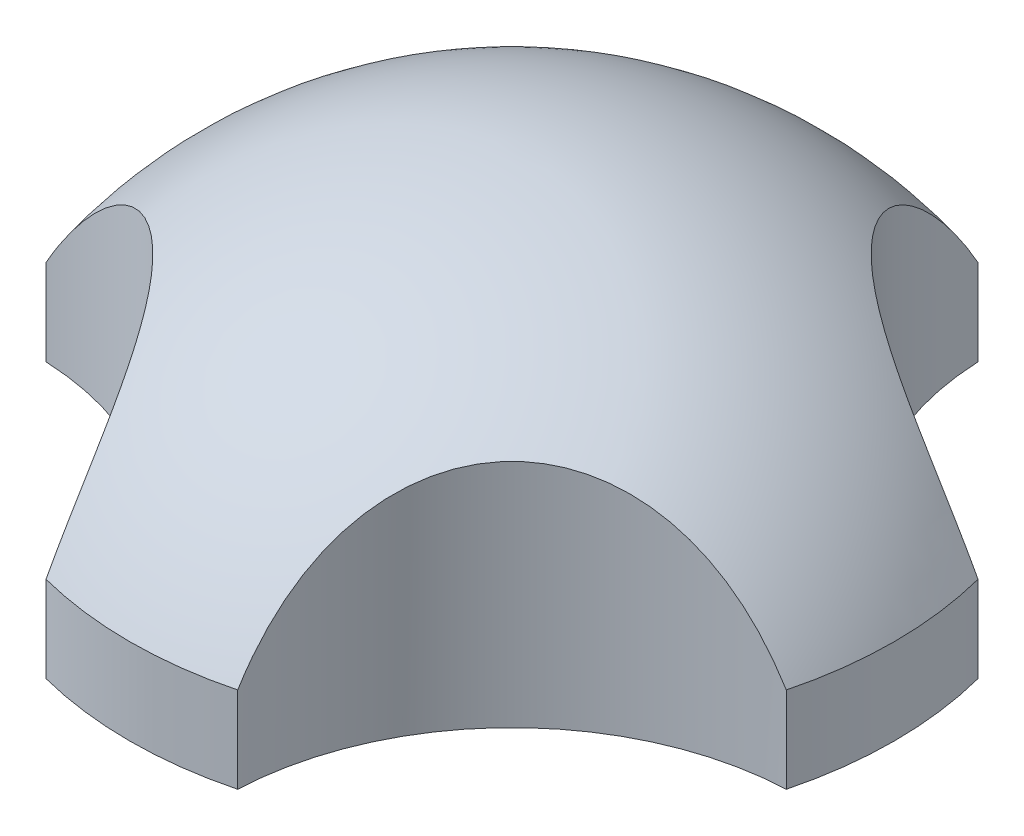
from build123d import *

# Parameters (mm, degrees)
CUT_EXTRUDE_1_REACH      = 74.691
CUT_EXTRUDE_1_END_RADIUS = 45.650848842


with BuildPart() as part:
    # Sketch 1 → Revolve 1 (revolve)
    with BuildSketch(Plane.XY, mode=Mode.PRIVATE) as revolve_1_sk:
        with BuildLine():
            Line((0, 8), (0, 45.650848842))
            ThreePointArc((0, 45.650848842), (-23.234471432, 39.29579287), (-40, 22))
            Line((-40, 22), (-40, 13))
            Line((-40, 13), (-19, 13))
            Line((-19, 13), (-19, 8))
            Line((-19, 8), (0, 8))
        make_face()
    revolve(revolve_1_sk.sketch.rotate(Axis((0, 0, 0), (0, -1, 0)), 270), axis=Axis((0, 0, 0), (0, -1, 0)))

    # Cut-Extrude 1: up to this sphere (the profile starts inside it)
    cut_extrude_1_end = Location((0, 0, 0)) * Sphere(CUT_EXTRUDE_1_END_RADIUS, mode=Mode.PRIVATE)
    # Sketch 2 → Cut-Extrude 1 (cut, up to the surface)
    with BuildSketch(Plane(origin=(0, 0, 0), x_dir=(1, 0, 0), z_dir=(0, 1, 0)), mode=Mode.PRIVATE) as cut_extrude_1_sk1:
        with BuildLine():
            ThreePointArc((38.722800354, -10.027199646), (18.786796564, -18.786796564), (10.027199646, -38.722800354))
            ThreePointArc((10.027199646, -38.722800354), (28.284271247, -28.284271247), (38.722800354, -10.027199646))
        make_face()
    cut_extrude_1_tool1 = extrude(cut_extrude_1_sk1.sketch, amount=CUT_EXTRUDE_1_REACH, mode=Mode.PRIVATE) & cut_extrude_1_end
    add(cut_extrude_1_tool1.solids().sort_by_distance((23.677686, 0, 23.677686))[0], mode=Mode.SUBTRACT)
    # Sketch 2 → Cut-Extrude 1 (cut, up to the surface)
    with BuildSketch(Plane(origin=(0, 0, 0), x_dir=(1, 0, 0), z_dir=(0, 1, 0)), mode=Mode.PRIVATE) as cut_extrude_1_sk2:
        with BuildLine():
            ThreePointArc((-38.722800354, -10.027199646), (-18.786796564, -18.786796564), (-10.027199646, -38.722800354))
            ThreePointArc((-10.027199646, -38.722800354), (-28.284271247, -28.284271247), (-38.722800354, -10.027199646))
        make_face()
    cut_extrude_1_tool2 = extrude(cut_extrude_1_sk2.sketch, amount=CUT_EXTRUDE_1_REACH, mode=Mode.PRIVATE) & cut_extrude_1_end
    add(cut_extrude_1_tool2.solids().sort_by_distance((-23.677686, 0, 23.677686))[0], mode=Mode.SUBTRACT)
    # Sketch 2 → Cut-Extrude 1 (cut, up to the surface)
    with BuildSketch(Plane(origin=(0, 0, 0), x_dir=(1, 0, 0), z_dir=(0, 1, 0)), mode=Mode.PRIVATE) as cut_extrude_1_sk3:
        with BuildLine():
            ThreePointArc((38.722800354, 10.027199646), (18.786796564, 18.786796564), (10.027199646, 38.722800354))
            ThreePointArc((10.027199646, 38.722800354), (28.284271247, 28.284271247), (38.722800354, 10.027199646))
        make_face()
    cut_extrude_1_tool3 = extrude(cut_extrude_1_sk3.sketch, amount=CUT_EXTRUDE_1_REACH, mode=Mode.PRIVATE) & cut_extrude_1_end
    add(cut_extrude_1_tool3.solids().sort_by_distance((23.677686, 0, -23.677686))[0], mode=Mode.SUBTRACT)
    # Sketch 2 → Cut-Extrude 1 (cut, up to the surface)
    with BuildSketch(Plane(origin=(0, 0, 0), x_dir=(1, 0, 0), z_dir=(0, 1, 0)), mode=Mode.PRIVATE) as cut_extrude_1_sk4:
        with BuildLine():
            ThreePointArc((-38.722800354, 10.027199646), (-18.786796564, 18.786796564), (-10.027199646, 38.722800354))
            ThreePointArc((-10.027199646, 38.722800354), (-28.284271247, 28.284271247), (-38.722800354, 10.027199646))
        make_face()
    cut_extrude_1_tool4 = extrude(cut_extrude_1_sk4.sketch, amount=CUT_EXTRUDE_1_REACH, mode=Mode.PRIVATE) & cut_extrude_1_end
    add(cut_extrude_1_tool4.solids().sort_by_distance((-23.677686, 0, -23.677686))[0], mode=Mode.SUBTRACT)


solid = part.part
